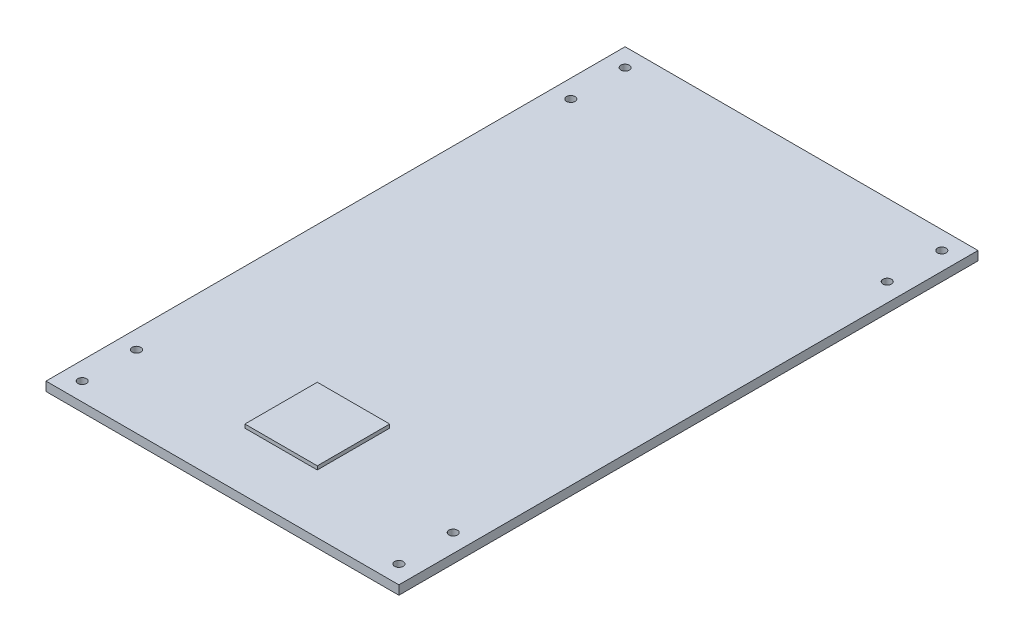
ISO-10303-21;
HEADER;
FILE_DESCRIPTION(('STEP AP214'),'2;1');
FILE_NAME('part.step','',(''),(''),'','','');
FILE_SCHEMA(('AUTOMOTIVE_DESIGN { 1 0 10303 214 1 1 1 1 }'));
ENDSEC;
DATA;
#1=APPLICATION_CONTEXT('core data for automotive mechanical design processes');
#2=APPLICATION_PROTOCOL_DEFINITION('international standard','automotive_design',2000,#1);
#3=PRODUCT_CONTEXT('',#1,'mechanical');
#4=PRODUCT('Part','Part','',(#3));
#5=PRODUCT_RELATED_PRODUCT_CATEGORY('part','',(#4));
#6=PRODUCT_DEFINITION_FORMATION('','',#4);
#7=PRODUCT_DEFINITION_CONTEXT('part definition',#1,'design');
#8=PRODUCT_DEFINITION('design','',#6,#7);
#9=PRODUCT_DEFINITION_SHAPE('','',#8);
#10=(LENGTH_UNIT() NAMED_UNIT(*) SI_UNIT(.MILLI.,.METRE.));
#11=(NAMED_UNIT(*) PLANE_ANGLE_UNIT() SI_UNIT($,.RADIAN.));
#12=(NAMED_UNIT(*) SI_UNIT($,.STERADIAN.) SOLID_ANGLE_UNIT());
#13=UNCERTAINTY_MEASURE_WITH_UNIT(LENGTH_MEASURE(1.E-05),#10,'distance_accuracy_value','');
#14=(GEOMETRIC_REPRESENTATION_CONTEXT(3) GLOBAL_UNCERTAINTY_ASSIGNED_CONTEXT((#13)) GLOBAL_UNIT_ASSIGNED_CONTEXT((#10,
#11,#12)) REPRESENTATION_CONTEXT('',''));
#15=CARTESIAN_POINT('',(0.,0.,0.));
#16=DIRECTION('',(0.,0.,1.));
#17=DIRECTION('',(1.,0.,0.));
#18=AXIS2_PLACEMENT_3D('',#15,#16,#17);
#19=CARTESIAN_POINT('',(0.,3.175,0.));
#20=DIRECTION('',(0.,-1.,0.));
#21=DIRECTION('',(0.,0.,-1.));
#22=AXIS2_PLACEMENT_3D('',#19,#20,#21);
#23=PLANE('',#22);
#24=DIRECTION('',(0.,0.,-1.));
#25=VECTOR('',#24,1.);
#26=CARTESIAN_POINT('',(61.9125,3.175,101.6));
#27=LINE('',#26,#25);
#28=CARTESIAN_POINT('',(61.9125,3.175,101.6));
#29=VERTEX_POINT('',#28);
#30=CARTESIAN_POINT('',(61.9125,3.175,-101.6));
#31=VERTEX_POINT('',#30);
#32=EDGE_CURVE('E179',#29,#31,#27,.T.);
#33=ORIENTED_EDGE('',*,*,#32,.T.);
#34=DIRECTION('',(-1.,0.,0.));
#35=VECTOR('',#34,1.);
#36=CARTESIAN_POINT('',(-61.9125,3.175,-101.6));
#37=LINE('',#36,#35);
#38=CARTESIAN_POINT('',(-61.9125,3.175,-101.6));
#39=VERTEX_POINT('',#38);
#40=EDGE_CURVE('E182',#31,#39,#37,.T.);
#41=ORIENTED_EDGE('',*,*,#40,.T.);
#42=DIRECTION('',(0.,0.,1.));
#43=VECTOR('',#42,1.);
#44=CARTESIAN_POINT('',(-61.9125,3.175,101.6));
#45=LINE('',#44,#43);
#46=CARTESIAN_POINT('',(-61.9125,3.175,101.6));
#47=VERTEX_POINT('',#46);
#48=EDGE_CURVE('E185',#39,#47,#45,.T.);
#49=ORIENTED_EDGE('',*,*,#48,.T.);
#50=DIRECTION('',(1.,0.,0.));
#51=VECTOR('',#50,1.);
#52=CARTESIAN_POINT('',(-61.9125,3.175,101.6));
#53=LINE('',#52,#51);
#54=EDGE_CURVE('E187',#47,#29,#53,.T.);
#55=ORIENTED_EDGE('',*,*,#54,.T.);
#56=EDGE_LOOP('',(#33,#41,#49,#55));
#57=FACE_BOUND('',#56,.T.);
#58=CARTESIAN_POINT('',(55.4582172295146,3.175,-76.2));
#59=DIRECTION('',(0.,1.,0.));
#60=DIRECTION('',(0.,0.,1.));
#61=AXIS2_PLACEMENT_3D('',#58,#59,#60);
#62=CIRCLE('',#61,1.49999999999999);
#63=CARTESIAN_POINT('',(55.4582172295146,3.175,-74.7));
#64=VERTEX_POINT('',#63);
#65=EDGE_CURVE('E172',#64,#64,#62,.T.);
#66=ORIENTED_EDGE('',*,*,#65,.F.);
#67=EDGE_LOOP('',(#66));
#68=FACE_BOUND('',#67,.T.);
#69=CARTESIAN_POINT('',(55.5625,3.175,-95.25));
#70=DIRECTION('',(0.,1.,0.));
#71=DIRECTION('',(0.,0.,1.));
#72=AXIS2_PLACEMENT_3D('',#69,#70,#71);
#73=CIRCLE('',#72,1.49999999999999);
#74=CARTESIAN_POINT('',(55.5625,3.175,-93.75));
#75=VERTEX_POINT('',#74);
#76=EDGE_CURVE('E166',#75,#75,#73,.T.);
#77=ORIENTED_EDGE('',*,*,#76,.F.);
#78=EDGE_LOOP('',(#77));
#79=FACE_BOUND('',#78,.T.);
#80=CARTESIAN_POINT('',(-55.5625,3.175,-76.2));
#81=DIRECTION('',(0.,1.,0.));
#82=DIRECTION('',(0.,0.,1.));
#83=AXIS2_PLACEMENT_3D('',#80,#81,#82);
#84=CIRCLE('',#83,1.49999999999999);
#85=CARTESIAN_POINT('',(-55.5625,3.175,-74.7));
#86=VERTEX_POINT('',#85);
#87=EDGE_CURVE('E160',#86,#86,#84,.T.);
#88=ORIENTED_EDGE('',*,*,#87,.F.);
#89=EDGE_LOOP('',(#88));
#90=FACE_BOUND('',#89,.T.);
#91=CARTESIAN_POINT('',(-55.5625,3.175,-95.25));
#92=DIRECTION('',(0.,1.,0.));
#93=DIRECTION('',(0.,0.,1.));
#94=AXIS2_PLACEMENT_3D('',#91,#92,#93);
#95=CIRCLE('',#94,1.49999999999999);
#96=CARTESIAN_POINT('',(-55.5625,3.175,-93.75));
#97=VERTEX_POINT('',#96);
#98=EDGE_CURVE('E154',#97,#97,#95,.T.);
#99=ORIENTED_EDGE('',*,*,#98,.F.);
#100=EDGE_LOOP('',(#99));
#101=FACE_BOUND('',#100,.T.);
#102=CARTESIAN_POINT('',(55.5625,3.175,76.2));
#103=DIRECTION('',(0.,1.,0.));
#104=DIRECTION('',(0.,0.,1.));
#105=AXIS2_PLACEMENT_3D('',#102,#103,#104);
#106=CIRCLE('',#105,1.49999999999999);
#107=CARTESIAN_POINT('',(55.5625,3.175,77.7));
#108=VERTEX_POINT('',#107);
#109=EDGE_CURVE('E148',#108,#108,#106,.T.);
#110=ORIENTED_EDGE('',*,*,#109,.F.);
#111=EDGE_LOOP('',(#110));
#112=FACE_BOUND('',#111,.T.);
#113=CARTESIAN_POINT('',(55.5625,3.175,95.25));
#114=DIRECTION('',(0.,1.,0.));
#115=DIRECTION('',(0.,0.,1.));
#116=AXIS2_PLACEMENT_3D('',#113,#114,#115);
#117=CIRCLE('',#116,1.49999999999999);
#118=CARTESIAN_POINT('',(55.5625,3.175,96.75));
#119=VERTEX_POINT('',#118);
#120=EDGE_CURVE('E142',#119,#119,#117,.T.);
#121=ORIENTED_EDGE('',*,*,#120,.F.);
#122=EDGE_LOOP('',(#121));
#123=FACE_BOUND('',#122,.T.);
#124=CARTESIAN_POINT('',(-55.5625,3.175,76.2));
#125=DIRECTION('',(0.,1.,0.));
#126=DIRECTION('',(0.,0.,1.));
#127=AXIS2_PLACEMENT_3D('',#124,#125,#126);
#128=CIRCLE('',#127,1.49999999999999);
#129=CARTESIAN_POINT('',(-55.5625,3.175,77.7));
#130=VERTEX_POINT('',#129);
#131=EDGE_CURVE('E136',#130,#130,#128,.T.);
#132=ORIENTED_EDGE('',*,*,#131,.F.);
#133=EDGE_LOOP('',(#132));
#134=FACE_BOUND('',#133,.T.);
#135=CARTESIAN_POINT('',(-55.5625,3.175,95.25));
#136=DIRECTION('',(0.,1.,0.));
#137=DIRECTION('',(0.,0.,1.));
#138=AXIS2_PLACEMENT_3D('',#135,#136,#137);
#139=CIRCLE('',#138,1.49999999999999);
#140=CARTESIAN_POINT('',(-55.5625,3.175,96.75));
#141=VERTEX_POINT('',#140);
#142=EDGE_CURVE('E125',#141,#141,#139,.T.);
#143=ORIENTED_EDGE('',*,*,#142,.F.);
#144=EDGE_LOOP('',(#143));
#145=FACE_BOUND('',#144,.T.);
#146=DIRECTION('',(0.,0.,-1.));
#147=VECTOR('',#146,1.);
#148=CARTESIAN_POINT('',(12.7000000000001,3.175,55.6225002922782));
#149=LINE('',#148,#147);
#150=CARTESIAN_POINT('',(12.7000000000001,3.175,81.0225002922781));
#151=VERTEX_POINT('',#150);
#152=CARTESIAN_POINT('',(12.7000000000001,3.175,55.6225002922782));
#153=VERTEX_POINT('',#152);
#154=EDGE_CURVE('E124',#151,#153,#149,.T.);
#155=ORIENTED_EDGE('',*,*,#154,.F.);
#156=DIRECTION('',(1.,0.,0.));
#157=VECTOR('',#156,1.);
#158=CARTESIAN_POINT('',(-12.7,3.175,81.0225002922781));
#159=LINE('',#158,#157);
#160=CARTESIAN_POINT('',(-12.7,3.175,81.0225002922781));
#161=VERTEX_POINT('',#160);
#162=EDGE_CURVE('E121',#161,#151,#159,.T.);
#163=ORIENTED_EDGE('',*,*,#162,.F.);
#164=DIRECTION('',(0.,0.,1.));
#165=VECTOR('',#164,1.);
#166=CARTESIAN_POINT('',(-12.7,3.175,55.6225002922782));
#167=LINE('',#166,#165);
#168=CARTESIAN_POINT('',(-12.7,3.175,55.6225002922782));
#169=VERTEX_POINT('',#168);
#170=EDGE_CURVE('E59',#169,#161,#167,.T.);
#171=ORIENTED_EDGE('',*,*,#170,.F.);
#172=DIRECTION('',(-1.,0.,0.));
#173=VECTOR('',#172,1.);
#174=CARTESIAN_POINT('',(-12.7,3.175,55.6225002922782));
#175=LINE('',#174,#173);
#176=EDGE_CURVE('E54',#153,#169,#175,.T.);
#177=ORIENTED_EDGE('',*,*,#176,.F.);
#178=EDGE_LOOP('',(#155,#163,#171,#177));
#179=FACE_BOUND('',#178,.T.);
#180=ADVANCED_FACE('F39',(#57,#68,#79,#90,#101,#112,#123,#134,#145,#179),#23,.F.);
#181=CARTESIAN_POINT('',(61.9125,3.175,101.6));
#182=DIRECTION('',(-1.,0.,0.));
#183=DIRECTION('',(0.,0.,1.));
#184=AXIS2_PLACEMENT_3D('',#181,#182,#183);
#185=PLANE('',#184);
#186=DIRECTION('',(0.,0.,-1.));
#187=VECTOR('',#186,1.);
#188=CARTESIAN_POINT('',(61.9125,0.,101.6));
#189=LINE('',#188,#187);
#190=CARTESIAN_POINT('',(61.9125,0.,101.6));
#191=VERTEX_POINT('',#190);
#192=CARTESIAN_POINT('',(61.9125,0.,-101.6));
#193=VERTEX_POINT('',#192);
#194=EDGE_CURVE('E178',#191,#193,#189,.T.);
#195=ORIENTED_EDGE('',*,*,#194,.T.);
#196=DIRECTION('',(0.,-1.,0.));
#197=VECTOR('',#196,1.);
#198=CARTESIAN_POINT('',(61.9125,3.175,-101.6));
#199=LINE('',#198,#197);
#200=EDGE_CURVE('E11',#31,#193,#199,.T.);
#201=ORIENTED_EDGE('',*,*,#200,.F.);
#202=ORIENTED_EDGE('',*,*,#32,.F.);
#203=DIRECTION('',(0.,-1.,0.));
#204=VECTOR('',#203,1.);
#205=CARTESIAN_POINT('',(61.9125,3.175,101.6));
#206=LINE('',#205,#204);
#207=EDGE_CURVE('E189',#29,#191,#206,.T.);
#208=ORIENTED_EDGE('',*,*,#207,.T.);
#209=EDGE_LOOP('',(#195,#201,#202,#208));
#210=FACE_BOUND('',#209,.T.);
#211=ADVANCED_FACE('F41',(#210),#185,.F.);
#212=CARTESIAN_POINT('',(-61.9125,3.175,-101.6));
#213=DIRECTION('',(0.,0.,1.));
#214=DIRECTION('',(1.,0.,0.));
#215=AXIS2_PLACEMENT_3D('',#212,#213,#214);
#216=PLANE('',#215);
#217=DIRECTION('',(-1.,0.,0.));
#218=VECTOR('',#217,1.);
#219=CARTESIAN_POINT('',(-61.9125,0.,-101.6));
#220=LINE('',#219,#218);
#221=CARTESIAN_POINT('',(-61.9125,0.,-101.6));
#222=VERTEX_POINT('',#221);
#223=EDGE_CURVE('E192',#193,#222,#220,.T.);
#224=ORIENTED_EDGE('',*,*,#223,.T.);
#225=DIRECTION('',(0.,-1.,0.));
#226=VECTOR('',#225,1.);
#227=CARTESIAN_POINT('',(-61.9125,3.175,-101.6));
#228=LINE('',#227,#226);
#229=EDGE_CURVE('E47',#39,#222,#228,.T.);
#230=ORIENTED_EDGE('',*,*,#229,.F.);
#231=ORIENTED_EDGE('',*,*,#40,.F.);
#232=ORIENTED_EDGE('',*,*,#200,.T.);
#233=EDGE_LOOP('',(#224,#230,#231,#232));
#234=FACE_BOUND('',#233,.T.);
#235=ADVANCED_FACE('F222',(#234),#216,.F.);
#236=CARTESIAN_POINT('',(-61.9125,3.175,101.6));
#237=DIRECTION('',(1.,0.,0.));
#238=DIRECTION('',(0.,0.,-1.));
#239=AXIS2_PLACEMENT_3D('',#236,#237,#238);
#240=PLANE('',#239);
#241=DIRECTION('',(0.,0.,1.));
#242=VECTOR('',#241,1.);
#243=CARTESIAN_POINT('',(-61.9125,0.,101.6));
#244=LINE('',#243,#242);
#245=CARTESIAN_POINT('',(-61.9125,0.,101.6));
#246=VERTEX_POINT('',#245);
#247=EDGE_CURVE('E194',#222,#246,#244,.T.);
#248=ORIENTED_EDGE('',*,*,#247,.T.);
#249=DIRECTION('',(0.,-1.,0.));
#250=VECTOR('',#249,1.);
#251=CARTESIAN_POINT('',(-61.9125,3.175,101.6));
#252=LINE('',#251,#250);
#253=EDGE_CURVE('E199',#47,#246,#252,.T.);
#254=ORIENTED_EDGE('',*,*,#253,.F.);
#255=ORIENTED_EDGE('',*,*,#48,.F.);
#256=ORIENTED_EDGE('',*,*,#229,.T.);
#257=EDGE_LOOP('',(#248,#254,#255,#256));
#258=FACE_BOUND('',#257,.T.);
#259=ADVANCED_FACE('F206',(#258),#240,.F.);
#260=CARTESIAN_POINT('',(-61.9125,3.175,101.6));
#261=DIRECTION('',(0.,0.,-1.));
#262=DIRECTION('',(-1.,0.,0.));
#263=AXIS2_PLACEMENT_3D('',#260,#261,#262);
#264=PLANE('',#263);
#265=DIRECTION('',(1.,0.,0.));
#266=VECTOR('',#265,1.);
#267=CARTESIAN_POINT('',(-61.9125,0.,101.6));
#268=LINE('',#267,#266);
#269=EDGE_CURVE('E183',#246,#191,#268,.T.);
#270=ORIENTED_EDGE('',*,*,#269,.T.);
#271=ORIENTED_EDGE('',*,*,#207,.F.);
#272=ORIENTED_EDGE('',*,*,#54,.F.);
#273=ORIENTED_EDGE('',*,*,#253,.T.);
#274=EDGE_LOOP('',(#270,#271,#272,#273));
#275=FACE_BOUND('',#274,.T.);
#276=ADVANCED_FACE('F215',(#275),#264,.F.);
#277=CARTESIAN_POINT('',(0.,0.,0.));
#278=DIRECTION('',(0.,-1.,0.));
#279=DIRECTION('',(0.,0.,-1.));
#280=AXIS2_PLACEMENT_3D('',#277,#278,#279);
#281=PLANE('',#280);
#282=CARTESIAN_POINT('',(-55.5625,0.,95.25));
#283=DIRECTION('',(0.,1.,0.));
#284=DIRECTION('',(0.,0.,1.));
#285=AXIS2_PLACEMENT_3D('',#282,#283,#284);
#286=CIRCLE('',#285,1.5);
#287=CARTESIAN_POINT('',(-55.5625,0.,96.75));
#288=VERTEX_POINT('',#287);
#289=EDGE_CURVE('E128',#288,#288,#286,.T.);
#290=ORIENTED_EDGE('',*,*,#289,.T.);
#291=EDGE_LOOP('',(#290));
#292=FACE_BOUND('',#291,.T.);
#293=CARTESIAN_POINT('',(-55.5625,0.,76.2));
#294=DIRECTION('',(0.,1.,0.));
#295=DIRECTION('',(0.,0.,1.));
#296=AXIS2_PLACEMENT_3D('',#293,#294,#295);
#297=CIRCLE('',#296,1.5);
#298=CARTESIAN_POINT('',(-55.5625,0.,77.7));
#299=VERTEX_POINT('',#298);
#300=EDGE_CURVE('E139',#299,#299,#297,.T.);
#301=ORIENTED_EDGE('',*,*,#300,.T.);
#302=EDGE_LOOP('',(#301));
#303=FACE_BOUND('',#302,.T.);
#304=CARTESIAN_POINT('',(55.5625,0.,95.25));
#305=DIRECTION('',(0.,1.,0.));
#306=DIRECTION('',(0.,0.,1.));
#307=AXIS2_PLACEMENT_3D('',#304,#305,#306);
#308=CIRCLE('',#307,1.5);
#309=CARTESIAN_POINT('',(55.5625,0.,96.75));
#310=VERTEX_POINT('',#309);
#311=EDGE_CURVE('E145',#310,#310,#308,.T.);
#312=ORIENTED_EDGE('',*,*,#311,.T.);
#313=EDGE_LOOP('',(#312));
#314=FACE_BOUND('',#313,.T.);
#315=CARTESIAN_POINT('',(55.5625,0.,76.2));
#316=DIRECTION('',(0.,1.,0.));
#317=DIRECTION('',(0.,0.,1.));
#318=AXIS2_PLACEMENT_3D('',#315,#316,#317);
#319=CIRCLE('',#318,1.5);
#320=CARTESIAN_POINT('',(55.5625,0.,77.7));
#321=VERTEX_POINT('',#320);
#322=EDGE_CURVE('E151',#321,#321,#319,.T.);
#323=ORIENTED_EDGE('',*,*,#322,.T.);
#324=EDGE_LOOP('',(#323));
#325=FACE_BOUND('',#324,.T.);
#326=CARTESIAN_POINT('',(-55.5625,0.,-95.25));
#327=DIRECTION('',(0.,1.,0.));
#328=DIRECTION('',(0.,0.,1.));
#329=AXIS2_PLACEMENT_3D('',#326,#327,#328);
#330=CIRCLE('',#329,1.5);
#331=CARTESIAN_POINT('',(-55.5625,0.,-93.75));
#332=VERTEX_POINT('',#331);
#333=EDGE_CURVE('E157',#332,#332,#330,.T.);
#334=ORIENTED_EDGE('',*,*,#333,.T.);
#335=EDGE_LOOP('',(#334));
#336=FACE_BOUND('',#335,.T.);
#337=CARTESIAN_POINT('',(-55.5625,0.,-76.2));
#338=DIRECTION('',(0.,1.,0.));
#339=DIRECTION('',(0.,0.,1.));
#340=AXIS2_PLACEMENT_3D('',#337,#338,#339);
#341=CIRCLE('',#340,1.5);
#342=CARTESIAN_POINT('',(-55.5625,0.,-74.7));
#343=VERTEX_POINT('',#342);
#344=EDGE_CURVE('E163',#343,#343,#341,.T.);
#345=ORIENTED_EDGE('',*,*,#344,.T.);
#346=EDGE_LOOP('',(#345));
#347=FACE_BOUND('',#346,.T.);
#348=CARTESIAN_POINT('',(55.5625,0.,-95.25));
#349=DIRECTION('',(0.,1.,0.));
#350=DIRECTION('',(0.,0.,1.));
#351=AXIS2_PLACEMENT_3D('',#348,#349,#350);
#352=CIRCLE('',#351,1.5);
#353=CARTESIAN_POINT('',(55.5625,0.,-93.75));
#354=VERTEX_POINT('',#353);
#355=EDGE_CURVE('E169',#354,#354,#352,.T.);
#356=ORIENTED_EDGE('',*,*,#355,.T.);
#357=EDGE_LOOP('',(#356));
#358=FACE_BOUND('',#357,.T.);
#359=CARTESIAN_POINT('',(55.4582172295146,0.,-76.2));
#360=DIRECTION('',(0.,1.,0.));
#361=DIRECTION('',(0.,0.,1.));
#362=AXIS2_PLACEMENT_3D('',#359,#360,#361);
#363=CIRCLE('',#362,1.5);
#364=CARTESIAN_POINT('',(55.4582172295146,0.,-74.7));
#365=VERTEX_POINT('',#364);
#366=EDGE_CURVE('E175',#365,#365,#363,.T.);
#367=ORIENTED_EDGE('',*,*,#366,.T.);
#368=EDGE_LOOP('',(#367));
#369=FACE_BOUND('',#368,.T.);
#370=ORIENTED_EDGE('',*,*,#194,.F.);
#371=ORIENTED_EDGE('',*,*,#269,.F.);
#372=ORIENTED_EDGE('',*,*,#247,.F.);
#373=ORIENTED_EDGE('',*,*,#223,.F.);
#374=EDGE_LOOP('',(#370,#371,#372,#373));
#375=FACE_BOUND('',#374,.T.);
#376=ADVANCED_FACE('F212',(#292,#303,#314,#325,#336,#347,#358,#369,#375),#281,.T.);
#377=CARTESIAN_POINT('',(55.4582172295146,3.175,-76.2));
#378=DIRECTION('',(0.,1.,0.));
#379=DIRECTION('',(0.,0.,1.));
#380=AXIS2_PLACEMENT_3D('',#377,#378,#379);
#381=CYLINDRICAL_SURFACE('',#380,1.49999999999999);
#382=ORIENTED_EDGE('',*,*,#366,.F.);
#383=EDGE_LOOP('',(#382));
#384=FACE_BOUND('',#383,.T.);
#385=ORIENTED_EDGE('',*,*,#65,.T.);
#386=EDGE_LOOP('',(#385));
#387=FACE_BOUND('',#386,.T.);
#388=ADVANCED_FACE('F237',(#384,#387),#381,.F.);
#389=CARTESIAN_POINT('',(55.5625,3.175,-95.25));
#390=DIRECTION('',(0.,1.,0.));
#391=DIRECTION('',(0.,0.,1.));
#392=AXIS2_PLACEMENT_3D('',#389,#390,#391);
#393=CYLINDRICAL_SURFACE('',#392,1.49999999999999);
#394=ORIENTED_EDGE('',*,*,#355,.F.);
#395=EDGE_LOOP('',(#394));
#396=FACE_BOUND('',#395,.T.);
#397=ORIENTED_EDGE('',*,*,#76,.T.);
#398=EDGE_LOOP('',(#397));
#399=FACE_BOUND('',#398,.T.);
#400=ADVANCED_FACE('F259',(#396,#399),#393,.F.);
#401=CARTESIAN_POINT('',(-55.5625,3.175,-76.2));
#402=DIRECTION('',(0.,1.,0.));
#403=DIRECTION('',(0.,0.,1.));
#404=AXIS2_PLACEMENT_3D('',#401,#402,#403);
#405=CYLINDRICAL_SURFACE('',#404,1.49999999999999);
#406=ORIENTED_EDGE('',*,*,#344,.F.);
#407=EDGE_LOOP('',(#406));
#408=FACE_BOUND('',#407,.T.);
#409=ORIENTED_EDGE('',*,*,#87,.T.);
#410=EDGE_LOOP('',(#409));
#411=FACE_BOUND('',#410,.T.);
#412=ADVANCED_FACE('F267',(#408,#411),#405,.F.);
#413=CARTESIAN_POINT('',(-55.5625,3.175,-95.25));
#414=DIRECTION('',(0.,1.,0.));
#415=DIRECTION('',(0.,0.,1.));
#416=AXIS2_PLACEMENT_3D('',#413,#414,#415);
#417=CYLINDRICAL_SURFACE('',#416,1.49999999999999);
#418=ORIENTED_EDGE('',*,*,#333,.F.);
#419=EDGE_LOOP('',(#418));
#420=FACE_BOUND('',#419,.T.);
#421=ORIENTED_EDGE('',*,*,#98,.T.);
#422=EDGE_LOOP('',(#421));
#423=FACE_BOUND('',#422,.T.);
#424=ADVANCED_FACE('F275',(#420,#423),#417,.F.);
#425=CARTESIAN_POINT('',(55.5625,3.175,76.2));
#426=DIRECTION('',(0.,1.,0.));
#427=DIRECTION('',(0.,0.,1.));
#428=AXIS2_PLACEMENT_3D('',#425,#426,#427);
#429=CYLINDRICAL_SURFACE('',#428,1.49999999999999);
#430=ORIENTED_EDGE('',*,*,#322,.F.);
#431=EDGE_LOOP('',(#430));
#432=FACE_BOUND('',#431,.T.);
#433=ORIENTED_EDGE('',*,*,#109,.T.);
#434=EDGE_LOOP('',(#433));
#435=FACE_BOUND('',#434,.T.);
#436=ADVANCED_FACE('F284',(#432,#435),#429,.F.);
#437=CARTESIAN_POINT('',(55.5625,3.175,95.25));
#438=DIRECTION('',(0.,1.,0.));
#439=DIRECTION('',(0.,0.,1.));
#440=AXIS2_PLACEMENT_3D('',#437,#438,#439);
#441=CYLINDRICAL_SURFACE('',#440,1.49999999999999);
#442=ORIENTED_EDGE('',*,*,#311,.F.);
#443=EDGE_LOOP('',(#442));
#444=FACE_BOUND('',#443,.T.);
#445=ORIENTED_EDGE('',*,*,#120,.T.);
#446=EDGE_LOOP('',(#445));
#447=FACE_BOUND('',#446,.T.);
#448=ADVANCED_FACE('F293',(#444,#447),#441,.F.);
#449=CARTESIAN_POINT('',(-55.5625,3.175,76.2));
#450=DIRECTION('',(0.,1.,0.));
#451=DIRECTION('',(0.,0.,1.));
#452=AXIS2_PLACEMENT_3D('',#449,#450,#451);
#453=CYLINDRICAL_SURFACE('',#452,1.49999999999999);
#454=ORIENTED_EDGE('',*,*,#300,.F.);
#455=EDGE_LOOP('',(#454));
#456=FACE_BOUND('',#455,.T.);
#457=ORIENTED_EDGE('',*,*,#131,.T.);
#458=EDGE_LOOP('',(#457));
#459=FACE_BOUND('',#458,.T.);
#460=ADVANCED_FACE('F302',(#456,#459),#453,.F.);
#461=CARTESIAN_POINT('',(-55.5625,3.175,95.25));
#462=DIRECTION('',(0.,1.,0.));
#463=DIRECTION('',(0.,0.,1.));
#464=AXIS2_PLACEMENT_3D('',#461,#462,#463);
#465=CYLINDRICAL_SURFACE('',#464,1.49999999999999);
#466=ORIENTED_EDGE('',*,*,#289,.F.);
#467=EDGE_LOOP('',(#466));
#468=FACE_BOUND('',#467,.T.);
#469=ORIENTED_EDGE('',*,*,#142,.T.);
#470=EDGE_LOOP('',(#469));
#471=FACE_BOUND('',#470,.T.);
#472=ADVANCED_FACE('F310',(#468,#471),#465,.F.);
#473=CARTESIAN_POINT('',(12.7000000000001,4.445,55.6225002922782));
#474=DIRECTION('',(-1.,0.,0.));
#475=DIRECTION('',(0.,0.,1.));
#476=AXIS2_PLACEMENT_3D('',#473,#474,#475);
#477=PLANE('',#476);
#478=ORIENTED_EDGE('',*,*,#154,.T.);
#479=DIRECTION('',(0.,-1.,0.));
#480=VECTOR('',#479,1.);
#481=CARTESIAN_POINT('',(12.7000000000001,4.445,55.6225002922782));
#482=LINE('',#481,#480);
#483=CARTESIAN_POINT('',(12.7000000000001,4.445,55.6225002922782));
#484=VERTEX_POINT('',#483);
#485=EDGE_CURVE('E105',#484,#153,#482,.T.);
#486=ORIENTED_EDGE('',*,*,#485,.F.);
#487=DIRECTION('',(0.,0.,-1.));
#488=VECTOR('',#487,1.);
#489=CARTESIAN_POINT('',(12.7000000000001,4.445,55.6225002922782));
#490=LINE('',#489,#488);
#491=CARTESIAN_POINT('',(12.7000000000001,4.445,81.0225002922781));
#492=VERTEX_POINT('',#491);
#493=EDGE_CURVE('E112',#492,#484,#490,.T.);
#494=ORIENTED_EDGE('',*,*,#493,.F.);
#495=DIRECTION('',(0.,-1.,0.));
#496=VECTOR('',#495,1.);
#497=CARTESIAN_POINT('',(12.7000000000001,4.445,81.0225002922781));
#498=LINE('',#497,#496);
#499=EDGE_CURVE('E373',#492,#151,#498,.T.);
#500=ORIENTED_EDGE('',*,*,#499,.T.);
#501=EDGE_LOOP('',(#478,#486,#494,#500));
#502=FACE_BOUND('',#501,.T.);
#503=ADVANCED_FACE('F123',(#502),#477,.F.);
#504=CARTESIAN_POINT('',(-12.7,4.445,55.6225002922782));
#505=DIRECTION('',(0.,0.,1.));
#506=DIRECTION('',(1.,0.,0.));
#507=AXIS2_PLACEMENT_3D('',#504,#505,#506);
#508=PLANE('',#507);
#509=ORIENTED_EDGE('',*,*,#176,.T.);
#510=DIRECTION('',(0.,-1.,0.));
#511=VECTOR('',#510,1.);
#512=CARTESIAN_POINT('',(-12.7,4.445,55.6225002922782));
#513=LINE('',#512,#511);
#514=CARTESIAN_POINT('',(-12.7,4.445,55.6225002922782));
#515=VERTEX_POINT('',#514);
#516=EDGE_CURVE('E108',#515,#169,#513,.T.);
#517=ORIENTED_EDGE('',*,*,#516,.F.);
#518=DIRECTION('',(-1.,0.,0.));
#519=VECTOR('',#518,1.);
#520=CARTESIAN_POINT('',(-12.7,4.445,55.6225002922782));
#521=LINE('',#520,#519);
#522=EDGE_CURVE('E101',#484,#515,#521,.T.);
#523=ORIENTED_EDGE('',*,*,#522,.F.);
#524=ORIENTED_EDGE('',*,*,#485,.T.);
#525=EDGE_LOOP('',(#509,#517,#523,#524));
#526=FACE_BOUND('',#525,.T.);
#527=ADVANCED_FACE('F103',(#526),#508,.F.);
#528=CARTESIAN_POINT('',(-12.7,4.445,55.6225002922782));
#529=DIRECTION('',(1.,0.,0.));
#530=DIRECTION('',(0.,0.,-1.));
#531=AXIS2_PLACEMENT_3D('',#528,#529,#530);
#532=PLANE('',#531);
#533=ORIENTED_EDGE('',*,*,#170,.T.);
#534=DIRECTION('',(0.,-1.,0.));
#535=VECTOR('',#534,1.);
#536=CARTESIAN_POINT('',(-12.7,4.445,81.0225002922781));
#537=LINE('',#536,#535);
#538=CARTESIAN_POINT('',(-12.7,4.445,81.0225002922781));
#539=VERTEX_POINT('',#538);
#540=EDGE_CURVE('E130',#539,#161,#537,.T.);
#541=ORIENTED_EDGE('',*,*,#540,.F.);
#542=DIRECTION('',(0.,0.,1.));
#543=VECTOR('',#542,1.);
#544=CARTESIAN_POINT('',(-12.7,4.445,55.6225002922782));
#545=LINE('',#544,#543);
#546=EDGE_CURVE('E111',#515,#539,#545,.T.);
#547=ORIENTED_EDGE('',*,*,#546,.F.);
#548=ORIENTED_EDGE('',*,*,#516,.T.);
#549=EDGE_LOOP('',(#533,#541,#547,#548));
#550=FACE_BOUND('',#549,.T.);
#551=ADVANCED_FACE('F341',(#550),#532,.F.);
#552=CARTESIAN_POINT('',(-12.7,4.445,81.0225002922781));
#553=DIRECTION('',(0.,0.,-1.));
#554=DIRECTION('',(-1.,0.,0.));
#555=AXIS2_PLACEMENT_3D('',#552,#553,#554);
#556=PLANE('',#555);
#557=ORIENTED_EDGE('',*,*,#162,.T.);
#558=ORIENTED_EDGE('',*,*,#499,.F.);
#559=DIRECTION('',(1.,0.,0.));
#560=VECTOR('',#559,1.);
#561=CARTESIAN_POINT('',(-12.7,4.445,81.0225002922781));
#562=LINE('',#561,#560);
#563=EDGE_CURVE('E117',#539,#492,#562,.T.);
#564=ORIENTED_EDGE('',*,*,#563,.F.);
#565=ORIENTED_EDGE('',*,*,#540,.T.);
#566=EDGE_LOOP('',(#557,#558,#564,#565));
#567=FACE_BOUND('',#566,.T.);
#568=ADVANCED_FACE('F350',(#567),#556,.F.);
#569=CARTESIAN_POINT('',(0.,4.445,0.));
#570=DIRECTION('',(0.,1.,0.));
#571=DIRECTION('',(0.,0.,1.));
#572=AXIS2_PLACEMENT_3D('',#569,#570,#571);
#573=PLANE('',#572);
#574=ORIENTED_EDGE('',*,*,#493,.T.);
#575=ORIENTED_EDGE('',*,*,#522,.T.);
#576=ORIENTED_EDGE('',*,*,#546,.T.);
#577=ORIENTED_EDGE('',*,*,#563,.T.);
#578=EDGE_LOOP('',(#574,#575,#576,#577));
#579=FACE_BOUND('',#578,.T.);
#580=ADVANCED_FACE('F115',(#579),#573,.T.);
#581=CLOSED_SHELL('',(#180,#211,#235,#259,#276,#376,#388,#400,#412,#424,#436,#448,#460,#472,
#503,#527,#551,#568,#580));
#582=MANIFOLD_SOLID_BREP('B2',#581);
#583=ADVANCED_BREP_SHAPE_REPRESENTATION('',(#18,#582),#14);
#584=SHAPE_DEFINITION_REPRESENTATION(#9,#583);
ENDSEC;
END-ISO-10303-21;
